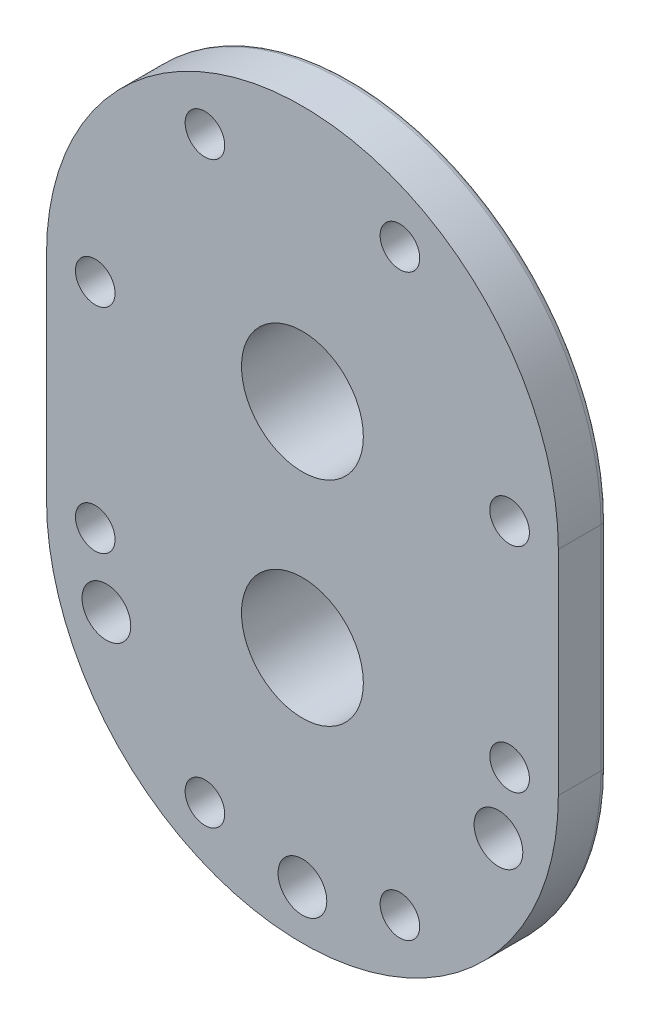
ISO-10303-21;
HEADER;
FILE_DESCRIPTION(('STEP AP214'),'2;1');
FILE_NAME('part.step','',(''),(''),'','','');
FILE_SCHEMA(('AUTOMOTIVE_DESIGN { 1 0 10303 214 1 1 1 1 }'));
ENDSEC;
DATA;
#1=APPLICATION_CONTEXT('core data for automotive mechanical design processes');
#2=APPLICATION_PROTOCOL_DEFINITION('international standard','automotive_design',2000,#1);
#3=PRODUCT_CONTEXT('',#1,'mechanical');
#4=PRODUCT('Part','Part','',(#3));
#5=PRODUCT_RELATED_PRODUCT_CATEGORY('part','',(#4));
#6=PRODUCT_DEFINITION_FORMATION('','',#4);
#7=PRODUCT_DEFINITION_CONTEXT('part definition',#1,'design');
#8=PRODUCT_DEFINITION('design','',#6,#7);
#9=PRODUCT_DEFINITION_SHAPE('','',#8);
#10=(LENGTH_UNIT() NAMED_UNIT(*) SI_UNIT(.MILLI.,.METRE.));
#11=(NAMED_UNIT(*) PLANE_ANGLE_UNIT() SI_UNIT($,.RADIAN.));
#12=(NAMED_UNIT(*) SI_UNIT($,.STERADIAN.) SOLID_ANGLE_UNIT());
#13=UNCERTAINTY_MEASURE_WITH_UNIT(LENGTH_MEASURE(1.E-05),#10,'distance_accuracy_value','');
#14=(GEOMETRIC_REPRESENTATION_CONTEXT(3) GLOBAL_UNCERTAINTY_ASSIGNED_CONTEXT((#13)) GLOBAL_UNIT_ASSIGNED_CONTEXT((#10,
#11,#12)) REPRESENTATION_CONTEXT('',''));
#15=CARTESIAN_POINT('',(0.,0.,0.));
#16=DIRECTION('',(0.,0.,1.));
#17=DIRECTION('',(1.,0.,0.));
#18=AXIS2_PLACEMENT_3D('',#15,#16,#17);
#19=CARTESIAN_POINT('',(0.,0.,-8.));
#20=DIRECTION('',(0.,0.,1.));
#21=DIRECTION('',(1.,0.,0.));
#22=AXIS2_PLACEMENT_3D('',#19,#20,#21);
#23=CYLINDRICAL_SURFACE('',#22,42.);
#24=DIRECTION('',(0.,0.,1.));
#25=VECTOR('',#24,1.);
#26=CARTESIAN_POINT('',(42.,0.,-8.));
#27=LINE('',#26,#25);
#28=CARTESIAN_POINT('',(42.,0.,-7.));
#29=VERTEX_POINT('',#28);
#30=CARTESIAN_POINT('',(42.,0.,0.));
#31=VERTEX_POINT('',#30);
#32=EDGE_CURVE('E173',#29,#31,#27,.T.);
#33=ORIENTED_EDGE('',*,*,#32,.F.);
#34=CARTESIAN_POINT('',(0.,0.,-7.));
#35=DIRECTION('',(0.,0.,1.));
#36=DIRECTION('',(1.,0.,0.));
#37=AXIS2_PLACEMENT_3D('',#34,#35,#36);
#38=CIRCLE('',#37,42.);
#39=CARTESIAN_POINT('',(-42.,0.,-7.));
#40=VERTEX_POINT('',#39);
#41=EDGE_CURVE('E145',#29,#40,#38,.T.);
#42=ORIENTED_EDGE('',*,*,#41,.T.);
#43=DIRECTION('',(0.,0.,1.));
#44=VECTOR('',#43,1.);
#45=CARTESIAN_POINT('',(-42.,0.,-8.));
#46=LINE('',#45,#44);
#47=CARTESIAN_POINT('',(-42.,0.,0.));
#48=VERTEX_POINT('',#47);
#49=EDGE_CURVE('E138',#40,#48,#46,.T.);
#50=ORIENTED_EDGE('',*,*,#49,.T.);
#51=CARTESIAN_POINT('',(0.,0.,0.));
#52=DIRECTION('',(0.,0.,1.));
#53=DIRECTION('',(1.,0.,0.));
#54=AXIS2_PLACEMENT_3D('',#51,#52,#53);
#55=CIRCLE('',#54,42.);
#56=EDGE_CURVE('E142',#31,#48,#55,.T.);
#57=ORIENTED_EDGE('',*,*,#56,.F.);
#58=EDGE_LOOP('',(#33,#42,#50,#57));
#59=FACE_BOUND('',#58,.T.);
#60=ADVANCED_FACE('F34',(#59),#23,.T.);
#61=CARTESIAN_POINT('',(42.,0.,-8.));
#62=DIRECTION('',(1.,0.,0.));
#63=DIRECTION('',(0.,1.,0.));
#64=AXIS2_PLACEMENT_3D('',#61,#62,#63);
#65=PLANE('',#64);
#66=DIRECTION('',(0.,0.,1.));
#67=VECTOR('',#66,1.);
#68=CARTESIAN_POINT('',(42.,-35.,-8.));
#69=LINE('',#68,#67);
#70=CARTESIAN_POINT('',(42.,-35.,-7.));
#71=VERTEX_POINT('',#70);
#72=CARTESIAN_POINT('',(42.,-35.,0.));
#73=VERTEX_POINT('',#72);
#74=EDGE_CURVE('E176',#71,#73,#69,.T.);
#75=ORIENTED_EDGE('',*,*,#74,.F.);
#76=DIRECTION('',(0.,1.,0.));
#77=VECTOR('',#76,1.);
#78=CARTESIAN_POINT('',(42.,0.,-7.));
#79=LINE('',#78,#77);
#80=EDGE_CURVE('E175',#71,#29,#79,.T.);
#81=ORIENTED_EDGE('',*,*,#80,.T.);
#82=ORIENTED_EDGE('',*,*,#32,.T.);
#83=DIRECTION('',(0.,1.,0.));
#84=VECTOR('',#83,1.);
#85=CARTESIAN_POINT('',(42.,0.,0.));
#86=LINE('',#85,#84);
#87=EDGE_CURVE('E149',#73,#31,#86,.T.);
#88=ORIENTED_EDGE('',*,*,#87,.F.);
#89=EDGE_LOOP('',(#75,#81,#82,#88));
#90=FACE_BOUND('',#89,.T.);
#91=ADVANCED_FACE('F419',(#90),#65,.T.);
#92=CARTESIAN_POINT('',(0.,-35.,-8.));
#93=DIRECTION('',(0.,0.,1.));
#94=DIRECTION('',(1.,0.,0.));
#95=AXIS2_PLACEMENT_3D('',#92,#93,#94);
#96=CYLINDRICAL_SURFACE('',#95,42.);
#97=DIRECTION('',(0.,0.,1.));
#98=VECTOR('',#97,1.);
#99=CARTESIAN_POINT('',(-42.,-35.,-8.));
#100=LINE('',#99,#98);
#101=CARTESIAN_POINT('',(-42.,-35.,-7.));
#102=VERTEX_POINT('',#101);
#103=CARTESIAN_POINT('',(-42.,-35.,0.));
#104=VERTEX_POINT('',#103);
#105=EDGE_CURVE('E148',#102,#104,#100,.T.);
#106=ORIENTED_EDGE('',*,*,#105,.F.);
#107=CARTESIAN_POINT('',(0.,-35.,-7.));
#108=DIRECTION('',(0.,0.,1.));
#109=DIRECTION('',(1.,0.,0.));
#110=AXIS2_PLACEMENT_3D('',#107,#108,#109);
#111=CIRCLE('',#110,42.);
#112=EDGE_CURVE('E199',#102,#71,#111,.T.);
#113=ORIENTED_EDGE('',*,*,#112,.T.);
#114=ORIENTED_EDGE('',*,*,#74,.T.);
#115=CARTESIAN_POINT('',(0.,-35.,0.));
#116=DIRECTION('',(0.,0.,1.));
#117=DIRECTION('',(1.,0.,0.));
#118=AXIS2_PLACEMENT_3D('',#115,#116,#117);
#119=CIRCLE('',#118,42.);
#120=EDGE_CURVE('E158',#104,#73,#119,.T.);
#121=ORIENTED_EDGE('',*,*,#120,.F.);
#122=EDGE_LOOP('',(#106,#113,#114,#121));
#123=FACE_BOUND('',#122,.T.);
#124=ADVANCED_FACE('F424',(#123),#96,.T.);
#125=CARTESIAN_POINT('',(-42.,0.,-8.));
#126=DIRECTION('',(-1.,0.,0.));
#127=DIRECTION('',(0.,-1.,0.));
#128=AXIS2_PLACEMENT_3D('',#125,#126,#127);
#129=PLANE('',#128);
#130=ORIENTED_EDGE('',*,*,#49,.F.);
#131=DIRECTION('',(0.,-1.,0.));
#132=VECTOR('',#131,1.);
#133=CARTESIAN_POINT('',(-42.,-35.,-7.));
#134=LINE('',#133,#132);
#135=EDGE_CURVE('E201',#40,#102,#134,.T.);
#136=ORIENTED_EDGE('',*,*,#135,.T.);
#137=ORIENTED_EDGE('',*,*,#105,.T.);
#138=DIRECTION('',(0.,-1.,0.));
#139=VECTOR('',#138,1.);
#140=CARTESIAN_POINT('',(-42.,0.,0.));
#141=LINE('',#140,#139);
#142=EDGE_CURVE('E152',#48,#104,#141,.T.);
#143=ORIENTED_EDGE('',*,*,#142,.F.);
#144=EDGE_LOOP('',(#130,#136,#137,#143));
#145=FACE_BOUND('',#144,.T.);
#146=ADVANCED_FACE('F153',(#145),#129,.T.);
#147=CARTESIAN_POINT('',(0.,0.,-8.));
#148=DIRECTION('',(0.,0.,1.));
#149=DIRECTION('',(1.,0.,0.));
#150=AXIS2_PLACEMENT_3D('',#147,#148,#149);
#151=PLANE('',#150);
#152=CARTESIAN_POINT('',(32.1714158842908,-46.,-8.));
#153=DIRECTION('',(0.,0.,1.));
#154=DIRECTION('',(1.,0.,0.));
#155=AXIS2_PLACEMENT_3D('',#152,#153,#154);
#156=CIRCLE('',#155,4.);
#157=CARTESIAN_POINT('',(36.1714158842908,-46.,-8.));
#158=VERTEX_POINT('',#157);
#159=EDGE_CURVE('E365',#158,#158,#156,.T.);
#160=ORIENTED_EDGE('',*,*,#159,.T.);
#161=EDGE_LOOP('',(#160));
#162=FACE_BOUND('',#161,.T.);
#163=CARTESIAN_POINT('',(0.,-69.,-8.));
#164=DIRECTION('',(0.,0.,1.));
#165=DIRECTION('',(1.,0.,0.));
#166=AXIS2_PLACEMENT_3D('',#163,#164,#165);
#167=CIRCLE('',#166,4.);
#168=CARTESIAN_POINT('',(4.00000000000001,-69.,-8.));
#169=VERTEX_POINT('',#168);
#170=EDGE_CURVE('E359',#169,#169,#167,.T.);
#171=ORIENTED_EDGE('',*,*,#170,.T.);
#172=EDGE_LOOP('',(#171));
#173=FACE_BOUND('',#172,.T.);
#174=CARTESIAN_POINT('',(-32.1714158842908,-46.,-8.));
#175=DIRECTION('',(0.,0.,1.));
#176=DIRECTION('',(1.,0.,0.));
#177=AXIS2_PLACEMENT_3D('',#174,#175,#176);
#178=CIRCLE('',#177,4.);
#179=CARTESIAN_POINT('',(-28.1714158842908,-46.,-8.));
#180=VERTEX_POINT('',#179);
#181=EDGE_CURVE('E249',#180,#180,#178,.T.);
#182=ORIENTED_EDGE('',*,*,#181,.T.);
#183=EDGE_LOOP('',(#182));
#184=FACE_BOUND('',#183,.T.);
#185=CARTESIAN_POINT('',(0.,0.,-8.));
#186=DIRECTION('',(0.,0.,1.));
#187=DIRECTION('',(1.,0.,0.));
#188=AXIS2_PLACEMENT_3D('',#185,#186,#187);
#189=CIRCLE('',#188,41.);
#190=CARTESIAN_POINT('',(-41.,0.,-8.));
#191=VERTEX_POINT('',#190);
#192=CARTESIAN_POINT('',(41.,0.,-8.));
#193=VERTEX_POINT('',#192);
#194=EDGE_CURVE('E190',#191,#193,#189,.F.);
#195=ORIENTED_EDGE('',*,*,#194,.T.);
#196=DIRECTION('',(0.,1.,0.));
#197=VECTOR('',#196,1.);
#198=CARTESIAN_POINT('',(41.,-35.,-8.));
#199=LINE('',#198,#197);
#200=CARTESIAN_POINT('',(41.,-35.,-8.));
#201=VERTEX_POINT('',#200);
#202=EDGE_CURVE('E196',#193,#201,#199,.F.);
#203=ORIENTED_EDGE('',*,*,#202,.T.);
#204=CARTESIAN_POINT('',(0.,-35.,-8.));
#205=DIRECTION('',(0.,0.,1.));
#206=DIRECTION('',(1.,0.,0.));
#207=AXIS2_PLACEMENT_3D('',#204,#205,#206);
#208=CIRCLE('',#207,41.);
#209=CARTESIAN_POINT('',(-41.,-35.,-8.));
#210=VERTEX_POINT('',#209);
#211=EDGE_CURVE('E194',#201,#210,#208,.F.);
#212=ORIENTED_EDGE('',*,*,#211,.T.);
#213=DIRECTION('',(0.,-1.,0.));
#214=VECTOR('',#213,1.);
#215=CARTESIAN_POINT('',(-41.,0.,-8.));
#216=LINE('',#215,#214);
#217=EDGE_CURVE('E192',#210,#191,#216,.F.);
#218=ORIENTED_EDGE('',*,*,#217,.T.);
#219=EDGE_LOOP('',(#195,#203,#212,#218));
#220=FACE_BOUND('',#219,.T.);
#221=CARTESIAN_POINT('',(0.,-35.,-8.));
#222=DIRECTION('',(0.,0.,1.));
#223=DIRECTION('',(1.,0.,0.));
#224=AXIS2_PLACEMENT_3D('',#221,#222,#223);
#225=CIRCLE('',#224,19.);
#226=CARTESIAN_POINT('',(-19.,-35.,-8.));
#227=VERTEX_POINT('',#226);
#228=CARTESIAN_POINT('',(19.,-35.,-8.));
#229=VERTEX_POINT('',#228);
#230=EDGE_CURVE('E185',#227,#229,#225,.T.);
#231=ORIENTED_EDGE('',*,*,#230,.T.);
#232=DIRECTION('',(0.,1.,0.));
#233=VECTOR('',#232,1.);
#234=CARTESIAN_POINT('',(19.,0.,-8.));
#235=LINE('',#234,#233);
#236=CARTESIAN_POINT('',(19.,0.,-8.));
#237=VERTEX_POINT('',#236);
#238=EDGE_CURVE('E187',#229,#237,#235,.T.);
#239=ORIENTED_EDGE('',*,*,#238,.T.);
#240=CARTESIAN_POINT('',(0.,0.,-8.));
#241=DIRECTION('',(0.,0.,1.));
#242=DIRECTION('',(1.,0.,0.));
#243=AXIS2_PLACEMENT_3D('',#240,#241,#242);
#244=CIRCLE('',#243,19.);
#245=CARTESIAN_POINT('',(-19.,0.,-8.));
#246=VERTEX_POINT('',#245);
#247=EDGE_CURVE('E181',#237,#246,#244,.T.);
#248=ORIENTED_EDGE('',*,*,#247,.T.);
#249=DIRECTION('',(0.,-1.,0.));
#250=VECTOR('',#249,1.);
#251=CARTESIAN_POINT('',(-19.,0.,-8.));
#252=LINE('',#251,#250);
#253=EDGE_CURVE('E183',#246,#227,#252,.T.);
#254=ORIENTED_EDGE('',*,*,#253,.T.);
#255=EDGE_LOOP('',(#231,#239,#248,#254));
#256=FACE_BOUND('',#255,.T.);
#257=CARTESIAN_POINT('',(-34.,0.,-8.));
#258=DIRECTION('',(0.,0.,1.));
#259=DIRECTION('',(1.,0.,0.));
#260=AXIS2_PLACEMENT_3D('',#257,#258,#259);
#261=CIRCLE('',#260,3.25);
#262=CARTESIAN_POINT('',(-30.75,0.,-8.));
#263=VERTEX_POINT('',#262);
#264=EDGE_CURVE('E349',#263,#263,#261,.T.);
#265=ORIENTED_EDGE('',*,*,#264,.T.);
#266=EDGE_LOOP('',(#265));
#267=FACE_BOUND('',#266,.T.);
#268=CARTESIAN_POINT('',(-34.,-35.0000000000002,-8.));
#269=DIRECTION('',(0.,0.,1.));
#270=DIRECTION('',(1.,0.,0.));
#271=AXIS2_PLACEMENT_3D('',#268,#269,#270);
#272=CIRCLE('',#271,3.25);
#273=CARTESIAN_POINT('',(-30.75,-35.0000000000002,-8.));
#274=VERTEX_POINT('',#273);
#275=EDGE_CURVE('E343',#274,#274,#272,.T.);
#276=ORIENTED_EDGE('',*,*,#275,.T.);
#277=EDGE_LOOP('',(#276));
#278=FACE_BOUND('',#277,.T.);
#279=CARTESIAN_POINT('',(-16.,-65.,-8.));
#280=DIRECTION('',(0.,0.,1.));
#281=DIRECTION('',(1.,0.,0.));
#282=AXIS2_PLACEMENT_3D('',#279,#280,#281);
#283=CIRCLE('',#282,3.25);
#284=CARTESIAN_POINT('',(-12.75,-65.,-8.));
#285=VERTEX_POINT('',#284);
#286=EDGE_CURVE('E337',#285,#285,#283,.T.);
#287=ORIENTED_EDGE('',*,*,#286,.T.);
#288=EDGE_LOOP('',(#287));
#289=FACE_BOUND('',#288,.T.);
#290=CARTESIAN_POINT('',(16.,-65.,-8.));
#291=DIRECTION('',(0.,0.,1.));
#292=DIRECTION('',(1.,0.,0.));
#293=AXIS2_PLACEMENT_3D('',#290,#291,#292);
#294=CIRCLE('',#293,3.25);
#295=CARTESIAN_POINT('',(19.25,-65.,-8.));
#296=VERTEX_POINT('',#295);
#297=EDGE_CURVE('E331',#296,#296,#294,.T.);
#298=ORIENTED_EDGE('',*,*,#297,.T.);
#299=EDGE_LOOP('',(#298));
#300=FACE_BOUND('',#299,.T.);
#301=CARTESIAN_POINT('',(34.,-35.,-8.));
#302=DIRECTION('',(0.,0.,1.));
#303=DIRECTION('',(1.,0.,0.));
#304=AXIS2_PLACEMENT_3D('',#301,#302,#303);
#305=CIRCLE('',#304,3.25);
#306=CARTESIAN_POINT('',(37.25,-35.,-8.));
#307=VERTEX_POINT('',#306);
#308=EDGE_CURVE('E325',#307,#307,#305,.T.);
#309=ORIENTED_EDGE('',*,*,#308,.T.);
#310=EDGE_LOOP('',(#309));
#311=FACE_BOUND('',#310,.T.);
#312=CARTESIAN_POINT('',(34.,0.,-8.));
#313=DIRECTION('',(0.,0.,1.));
#314=DIRECTION('',(1.,0.,0.));
#315=AXIS2_PLACEMENT_3D('',#312,#313,#314);
#316=CIRCLE('',#315,3.25);
#317=CARTESIAN_POINT('',(37.25,0.,-8.));
#318=VERTEX_POINT('',#317);
#319=EDGE_CURVE('E319',#318,#318,#316,.T.);
#320=ORIENTED_EDGE('',*,*,#319,.T.);
#321=EDGE_LOOP('',(#320));
#322=FACE_BOUND('',#321,.T.);
#323=CARTESIAN_POINT('',(16.,30.,-8.));
#324=DIRECTION('',(0.,0.,1.));
#325=DIRECTION('',(1.,0.,0.));
#326=AXIS2_PLACEMENT_3D('',#323,#324,#325);
#327=CIRCLE('',#326,3.25);
#328=CARTESIAN_POINT('',(19.25,30.,-8.));
#329=VERTEX_POINT('',#328);
#330=EDGE_CURVE('E313',#329,#329,#327,.T.);
#331=ORIENTED_EDGE('',*,*,#330,.T.);
#332=EDGE_LOOP('',(#331));
#333=FACE_BOUND('',#332,.T.);
#334=CARTESIAN_POINT('',(-16.,30.,-8.));
#335=DIRECTION('',(0.,0.,1.));
#336=DIRECTION('',(1.,0.,0.));
#337=AXIS2_PLACEMENT_3D('',#334,#335,#336);
#338=CIRCLE('',#337,3.25);
#339=CARTESIAN_POINT('',(-12.75,30.,-8.));
#340=VERTEX_POINT('',#339);
#341=EDGE_CURVE('E305',#340,#340,#338,.T.);
#342=ORIENTED_EDGE('',*,*,#341,.T.);
#343=EDGE_LOOP('',(#342));
#344=FACE_BOUND('',#343,.T.);
#345=ADVANCED_FACE('F377',(#162,#173,#184,#220,#256,#267,#278,#289,#300,#311,#322,#333,#344),
#151,.F.);
#346=CARTESIAN_POINT('',(0.,0.,0.));
#347=DIRECTION('',(0.,0.,1.));
#348=DIRECTION('',(1.,0.,0.));
#349=AXIS2_PLACEMENT_3D('',#346,#347,#348);
#350=PLANE('',#349);
#351=CARTESIAN_POINT('',(32.1714158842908,-46.,0.));
#352=DIRECTION('',(0.,0.,1.));
#353=DIRECTION('',(1.,0.,0.));
#354=AXIS2_PLACEMENT_3D('',#351,#352,#353);
#355=CIRCLE('',#354,4.);
#356=CARTESIAN_POINT('',(36.1714158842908,-46.,0.));
#357=VERTEX_POINT('',#356);
#358=EDGE_CURVE('E368',#357,#357,#355,.T.);
#359=ORIENTED_EDGE('',*,*,#358,.F.);
#360=EDGE_LOOP('',(#359));
#361=FACE_BOUND('',#360,.T.);
#362=CARTESIAN_POINT('',(0.,-69.,0.));
#363=DIRECTION('',(0.,0.,1.));
#364=DIRECTION('',(1.,0.,0.));
#365=AXIS2_PLACEMENT_3D('',#362,#363,#364);
#366=CIRCLE('',#365,4.);
#367=CARTESIAN_POINT('',(4.00000000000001,-69.,0.));
#368=VERTEX_POINT('',#367);
#369=EDGE_CURVE('E362',#368,#368,#366,.T.);
#370=ORIENTED_EDGE('',*,*,#369,.F.);
#371=EDGE_LOOP('',(#370));
#372=FACE_BOUND('',#371,.T.);
#373=CARTESIAN_POINT('',(-32.1714158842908,-46.,0.));
#374=DIRECTION('',(0.,0.,1.));
#375=DIRECTION('',(1.,0.,0.));
#376=AXIS2_PLACEMENT_3D('',#373,#374,#375);
#377=CIRCLE('',#376,4.);
#378=CARTESIAN_POINT('',(-28.1714158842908,-46.,0.));
#379=VERTEX_POINT('',#378);
#380=EDGE_CURVE('E356',#379,#379,#377,.T.);
#381=ORIENTED_EDGE('',*,*,#380,.F.);
#382=EDGE_LOOP('',(#381));
#383=FACE_BOUND('',#382,.T.);
#384=CARTESIAN_POINT('',(-34.,0.,0.));
#385=DIRECTION('',(0.,0.,1.));
#386=DIRECTION('',(1.,0.,0.));
#387=AXIS2_PLACEMENT_3D('',#384,#385,#386);
#388=CIRCLE('',#387,3.25);
#389=CARTESIAN_POINT('',(-30.75,0.,0.));
#390=VERTEX_POINT('',#389);
#391=EDGE_CURVE('E237',#390,#390,#388,.T.);
#392=ORIENTED_EDGE('',*,*,#391,.F.);
#393=EDGE_LOOP('',(#392));
#394=FACE_BOUND('',#393,.T.);
#395=CARTESIAN_POINT('',(-34.,-35.0000000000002,0.));
#396=DIRECTION('',(0.,0.,1.));
#397=DIRECTION('',(1.,0.,0.));
#398=AXIS2_PLACEMENT_3D('',#395,#396,#397);
#399=CIRCLE('',#398,3.25);
#400=CARTESIAN_POINT('',(-30.75,-35.0000000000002,0.));
#401=VERTEX_POINT('',#400);
#402=EDGE_CURVE('E346',#401,#401,#399,.T.);
#403=ORIENTED_EDGE('',*,*,#402,.F.);
#404=EDGE_LOOP('',(#403));
#405=FACE_BOUND('',#404,.T.);
#406=CARTESIAN_POINT('',(-16.,-65.,0.));
#407=DIRECTION('',(0.,0.,1.));
#408=DIRECTION('',(1.,0.,0.));
#409=AXIS2_PLACEMENT_3D('',#406,#407,#408);
#410=CIRCLE('',#409,3.25);
#411=CARTESIAN_POINT('',(-12.75,-65.,0.));
#412=VERTEX_POINT('',#411);
#413=EDGE_CURVE('E340',#412,#412,#410,.T.);
#414=ORIENTED_EDGE('',*,*,#413,.F.);
#415=EDGE_LOOP('',(#414));
#416=FACE_BOUND('',#415,.T.);
#417=CARTESIAN_POINT('',(16.,-65.,0.));
#418=DIRECTION('',(0.,0.,1.));
#419=DIRECTION('',(1.,0.,0.));
#420=AXIS2_PLACEMENT_3D('',#417,#418,#419);
#421=CIRCLE('',#420,3.25);
#422=CARTESIAN_POINT('',(19.25,-65.,0.));
#423=VERTEX_POINT('',#422);
#424=EDGE_CURVE('E334',#423,#423,#421,.T.);
#425=ORIENTED_EDGE('',*,*,#424,.F.);
#426=EDGE_LOOP('',(#425));
#427=FACE_BOUND('',#426,.T.);
#428=CARTESIAN_POINT('',(34.,-35.,0.));
#429=DIRECTION('',(0.,0.,1.));
#430=DIRECTION('',(1.,0.,0.));
#431=AXIS2_PLACEMENT_3D('',#428,#429,#430);
#432=CIRCLE('',#431,3.25);
#433=CARTESIAN_POINT('',(37.25,-35.,0.));
#434=VERTEX_POINT('',#433);
#435=EDGE_CURVE('E328',#434,#434,#432,.T.);
#436=ORIENTED_EDGE('',*,*,#435,.F.);
#437=EDGE_LOOP('',(#436));
#438=FACE_BOUND('',#437,.T.);
#439=CARTESIAN_POINT('',(34.,0.,0.));
#440=DIRECTION('',(0.,0.,1.));
#441=DIRECTION('',(1.,0.,0.));
#442=AXIS2_PLACEMENT_3D('',#439,#440,#441);
#443=CIRCLE('',#442,3.25);
#444=CARTESIAN_POINT('',(37.25,0.,0.));
#445=VERTEX_POINT('',#444);
#446=EDGE_CURVE('E322',#445,#445,#443,.T.);
#447=ORIENTED_EDGE('',*,*,#446,.F.);
#448=EDGE_LOOP('',(#447));
#449=FACE_BOUND('',#448,.T.);
#450=CARTESIAN_POINT('',(16.,30.,0.));
#451=DIRECTION('',(0.,0.,1.));
#452=DIRECTION('',(1.,0.,0.));
#453=AXIS2_PLACEMENT_3D('',#450,#451,#452);
#454=CIRCLE('',#453,3.25);
#455=CARTESIAN_POINT('',(19.25,30.,0.));
#456=VERTEX_POINT('',#455);
#457=EDGE_CURVE('E316',#456,#456,#454,.T.);
#458=ORIENTED_EDGE('',*,*,#457,.F.);
#459=EDGE_LOOP('',(#458));
#460=FACE_BOUND('',#459,.T.);
#461=CARTESIAN_POINT('',(-16.,30.,0.));
#462=DIRECTION('',(0.,0.,1.));
#463=DIRECTION('',(1.,0.,0.));
#464=AXIS2_PLACEMENT_3D('',#461,#462,#463);
#465=CIRCLE('',#464,3.25);
#466=CARTESIAN_POINT('',(-12.75,30.,0.));
#467=VERTEX_POINT('',#466);
#468=EDGE_CURVE('E310',#467,#467,#465,.T.);
#469=ORIENTED_EDGE('',*,*,#468,.F.);
#470=EDGE_LOOP('',(#469));
#471=FACE_BOUND('',#470,.T.);
#472=CARTESIAN_POINT('',(0.,-35.,0.));
#473=DIRECTION('',(0.,0.,1.));
#474=DIRECTION('',(1.,0.,0.));
#475=AXIS2_PLACEMENT_3D('',#472,#473,#474);
#476=CIRCLE('',#475,10.);
#477=CARTESIAN_POINT('',(10.,-35.,0.));
#478=VERTEX_POINT('',#477);
#479=EDGE_CURVE('E302',#478,#478,#476,.T.);
#480=ORIENTED_EDGE('',*,*,#479,.F.);
#481=EDGE_LOOP('',(#480));
#482=FACE_BOUND('',#481,.T.);
#483=CARTESIAN_POINT('',(0.,0.,0.));
#484=DIRECTION('',(0.,0.,1.));
#485=DIRECTION('',(1.,0.,0.));
#486=AXIS2_PLACEMENT_3D('',#483,#484,#485);
#487=CIRCLE('',#486,10.);
#488=CARTESIAN_POINT('',(10.,0.,0.));
#489=VERTEX_POINT('',#488);
#490=EDGE_CURVE('E295',#489,#489,#487,.T.);
#491=ORIENTED_EDGE('',*,*,#490,.F.);
#492=EDGE_LOOP('',(#491));
#493=FACE_BOUND('',#492,.T.);
#494=ORIENTED_EDGE('',*,*,#56,.T.);
#495=ORIENTED_EDGE('',*,*,#142,.T.);
#496=ORIENTED_EDGE('',*,*,#120,.T.);
#497=ORIENTED_EDGE('',*,*,#87,.T.);
#498=EDGE_LOOP('',(#494,#495,#496,#497));
#499=FACE_BOUND('',#498,.T.);
#500=ADVANCED_FACE('F160',(#361,#372,#383,#394,#405,#416,#427,#438,#449,#460,#471,#482,#493,
#499),#350,.T.);
#501=CARTESIAN_POINT('',(0.,0.,-24.5));
#502=DIRECTION('',(0.,0.,1.));
#503=DIRECTION('',(1.,0.,0.));
#504=AXIS2_PLACEMENT_3D('',#501,#502,#503);
#505=CYLINDRICAL_SURFACE('',#504,18.);
#506=DIRECTION('',(0.,0.,1.));
#507=VECTOR('',#506,1.);
#508=CARTESIAN_POINT('',(-18.,0.,-24.5));
#509=LINE('',#508,#507);
#510=CARTESIAN_POINT('',(-18.,0.,-23.5));
#511=VERTEX_POINT('',#510);
#512=CARTESIAN_POINT('',(-18.,0.,-9.));
#513=VERTEX_POINT('',#512);
#514=EDGE_CURVE('E168',#511,#513,#509,.T.);
#515=ORIENTED_EDGE('',*,*,#514,.T.);
#516=CARTESIAN_POINT('',(0.,0.,-9.));
#517=DIRECTION('',(0.,0.,1.));
#518=DIRECTION('',(1.,0.,0.));
#519=AXIS2_PLACEMENT_3D('',#516,#517,#518);
#520=CIRCLE('',#519,18.);
#521=CARTESIAN_POINT('',(18.,0.,-9.));
#522=VERTEX_POINT('',#521);
#523=EDGE_CURVE('E11',#513,#522,#520,.F.);
#524=ORIENTED_EDGE('',*,*,#523,.T.);
#525=DIRECTION('',(0.,0.,1.));
#526=VECTOR('',#525,1.);
#527=CARTESIAN_POINT('',(18.,0.,-24.5));
#528=LINE('',#527,#526);
#529=CARTESIAN_POINT('',(18.,0.,-23.5));
#530=VERTEX_POINT('',#529);
#531=EDGE_CURVE('E162',#530,#522,#528,.T.);
#532=ORIENTED_EDGE('',*,*,#531,.F.);
#533=CARTESIAN_POINT('',(0.,0.,-23.5));
#534=DIRECTION('',(0.,0.,1.));
#535=DIRECTION('',(1.,0.,0.));
#536=AXIS2_PLACEMENT_3D('',#533,#534,#535);
#537=CIRCLE('',#536,18.);
#538=EDGE_CURVE('E43',#530,#511,#537,.T.);
#539=ORIENTED_EDGE('',*,*,#538,.T.);
#540=EDGE_LOOP('',(#515,#524,#532,#539));
#541=FACE_BOUND('',#540,.T.);
#542=ADVANCED_FACE('F276',(#541),#505,.T.);
#543=CARTESIAN_POINT('',(18.,0.,-24.5));
#544=DIRECTION('',(1.,0.,0.));
#545=DIRECTION('',(0.,1.,0.));
#546=AXIS2_PLACEMENT_3D('',#543,#544,#545);
#547=PLANE('',#546);
#548=ORIENTED_EDGE('',*,*,#531,.T.);
#549=DIRECTION('',(0.,1.,0.));
#550=VECTOR('',#549,1.);
#551=CARTESIAN_POINT('',(18.,0.,-9.));
#552=LINE('',#551,#550);
#553=CARTESIAN_POINT('',(18.,-35.,-9.));
#554=VERTEX_POINT('',#553);
#555=EDGE_CURVE('E206',#522,#554,#552,.F.);
#556=ORIENTED_EDGE('',*,*,#555,.T.);
#557=DIRECTION('',(0.,0.,1.));
#558=VECTOR('',#557,1.);
#559=CARTESIAN_POINT('',(18.,-35.,-24.5));
#560=LINE('',#559,#558);
#561=CARTESIAN_POINT('',(18.,-35.,-23.5));
#562=VERTEX_POINT('',#561);
#563=EDGE_CURVE('E165',#562,#554,#560,.T.);
#564=ORIENTED_EDGE('',*,*,#563,.F.);
#565=DIRECTION('',(0.,1.,0.));
#566=VECTOR('',#565,1.);
#567=CARTESIAN_POINT('',(18.,0.,-23.5));
#568=LINE('',#567,#566);
#569=EDGE_CURVE('E203',#562,#530,#568,.T.);
#570=ORIENTED_EDGE('',*,*,#569,.T.);
#571=EDGE_LOOP('',(#548,#556,#564,#570));
#572=FACE_BOUND('',#571,.T.);
#573=ADVANCED_FACE('F273',(#572),#547,.T.);
#574=CARTESIAN_POINT('',(0.,-35.,-24.5));
#575=DIRECTION('',(0.,0.,1.));
#576=DIRECTION('',(1.,0.,0.));
#577=AXIS2_PLACEMENT_3D('',#574,#575,#576);
#578=CYLINDRICAL_SURFACE('',#577,18.);
#579=ORIENTED_EDGE('',*,*,#563,.T.);
#580=CARTESIAN_POINT('',(0.,-35.,-9.));
#581=DIRECTION('',(0.,0.,1.));
#582=DIRECTION('',(1.,0.,0.));
#583=AXIS2_PLACEMENT_3D('',#580,#581,#582);
#584=CIRCLE('',#583,18.);
#585=CARTESIAN_POINT('',(-18.,-35.,-9.));
#586=VERTEX_POINT('',#585);
#587=EDGE_CURVE('E211',#554,#586,#584,.F.);
#588=ORIENTED_EDGE('',*,*,#587,.T.);
#589=DIRECTION('',(0.,0.,1.));
#590=VECTOR('',#589,1.);
#591=CARTESIAN_POINT('',(-18.,-35.,-24.5));
#592=LINE('',#591,#590);
#593=CARTESIAN_POINT('',(-18.,-35.,-23.5));
#594=VERTEX_POINT('',#593);
#595=EDGE_CURVE('E292',#594,#586,#592,.T.);
#596=ORIENTED_EDGE('',*,*,#595,.F.);
#597=CARTESIAN_POINT('',(0.,-35.,-23.5));
#598=DIRECTION('',(0.,0.,1.));
#599=DIRECTION('',(1.,0.,0.));
#600=AXIS2_PLACEMENT_3D('',#597,#598,#599);
#601=CIRCLE('',#600,18.);
#602=EDGE_CURVE('E209',#594,#562,#601,.T.);
#603=ORIENTED_EDGE('',*,*,#602,.T.);
#604=EDGE_LOOP('',(#579,#588,#596,#603));
#605=FACE_BOUND('',#604,.T.);
#606=ADVANCED_FACE('F289',(#605),#578,.T.);
#607=CARTESIAN_POINT('',(-18.,0.,-24.5));
#608=DIRECTION('',(-1.,0.,0.));
#609=DIRECTION('',(0.,-1.,0.));
#610=AXIS2_PLACEMENT_3D('',#607,#608,#609);
#611=PLANE('',#610);
#612=ORIENTED_EDGE('',*,*,#595,.T.);
#613=DIRECTION('',(0.,-1.,0.));
#614=VECTOR('',#613,1.);
#615=CARTESIAN_POINT('',(-18.,0.,-9.));
#616=LINE('',#615,#614);
#617=EDGE_CURVE('E215',#586,#513,#616,.F.);
#618=ORIENTED_EDGE('',*,*,#617,.T.);
#619=ORIENTED_EDGE('',*,*,#514,.F.);
#620=DIRECTION('',(0.,-1.,0.));
#621=VECTOR('',#620,1.);
#622=CARTESIAN_POINT('',(-18.,-35.,-23.5));
#623=LINE('',#622,#621);
#624=EDGE_CURVE('E213',#511,#594,#623,.T.);
#625=ORIENTED_EDGE('',*,*,#624,.T.);
#626=EDGE_LOOP('',(#612,#618,#619,#625));
#627=FACE_BOUND('',#626,.T.);
#628=ADVANCED_FACE('F415',(#627),#611,.T.);
#629=CARTESIAN_POINT('',(0.,0.,-24.5));
#630=DIRECTION('',(0.,0.,1.));
#631=DIRECTION('',(1.,0.,0.));
#632=AXIS2_PLACEMENT_3D('',#629,#630,#631);
#633=PLANE('',#632);
#634=CARTESIAN_POINT('',(0.,0.,-24.5));
#635=DIRECTION('',(0.,0.,1.));
#636=DIRECTION('',(1.,0.,0.));
#637=AXIS2_PLACEMENT_3D('',#634,#635,#636);
#638=CIRCLE('',#637,17.);
#639=CARTESIAN_POINT('',(-17.,0.,-24.5));
#640=VERTEX_POINT('',#639);
#641=CARTESIAN_POINT('',(17.,0.,-24.5));
#642=VERTEX_POINT('',#641);
#643=EDGE_CURVE('E217',#640,#642,#638,.F.);
#644=ORIENTED_EDGE('',*,*,#643,.T.);
#645=DIRECTION('',(0.,1.,0.));
#646=VECTOR('',#645,1.);
#647=CARTESIAN_POINT('',(17.,-35.,-24.5));
#648=LINE('',#647,#646);
#649=CARTESIAN_POINT('',(17.,-35.,-24.5));
#650=VERTEX_POINT('',#649);
#651=EDGE_CURVE('E222',#642,#650,#648,.F.);
#652=ORIENTED_EDGE('',*,*,#651,.T.);
#653=CARTESIAN_POINT('',(0.,-35.,-24.5));
#654=DIRECTION('',(0.,0.,1.));
#655=DIRECTION('',(1.,0.,0.));
#656=AXIS2_PLACEMENT_3D('',#653,#654,#655);
#657=CIRCLE('',#656,17.);
#658=CARTESIAN_POINT('',(-17.,-35.,-24.5));
#659=VERTEX_POINT('',#658);
#660=EDGE_CURVE('E58',#650,#659,#657,.F.);
#661=ORIENTED_EDGE('',*,*,#660,.T.);
#662=DIRECTION('',(0.,-1.,0.));
#663=VECTOR('',#662,1.);
#664=CARTESIAN_POINT('',(-17.,0.,-24.5));
#665=LINE('',#664,#663);
#666=EDGE_CURVE('E219',#659,#640,#665,.F.);
#667=ORIENTED_EDGE('',*,*,#666,.T.);
#668=EDGE_LOOP('',(#644,#652,#661,#667));
#669=FACE_BOUND('',#668,.T.);
#670=ADVANCED_FACE('F263',(#669),#633,.F.);
#671=CARTESIAN_POINT('',(0.,0.,-19.5));
#672=DIRECTION('',(0.,0.,1.));
#673=DIRECTION('',(1.,0.,0.));
#674=AXIS2_PLACEMENT_3D('',#671,#672,#673);
#675=CYLINDRICAL_SURFACE('',#674,10.);
#676=CARTESIAN_POINT('',(0.,0.,-19.5));
#677=DIRECTION('',(0.,0.,1.));
#678=DIRECTION('',(1.,0.,0.));
#679=AXIS2_PLACEMENT_3D('',#676,#677,#678);
#680=CIRCLE('',#679,10.);
#681=CARTESIAN_POINT('',(10.,0.,-19.5));
#682=VERTEX_POINT('',#681);
#683=EDGE_CURVE('E298',#682,#682,#680,.T.);
#684=ORIENTED_EDGE('',*,*,#683,.F.);
#685=EDGE_LOOP('',(#684));
#686=FACE_BOUND('',#685,.T.);
#687=ORIENTED_EDGE('',*,*,#490,.T.);
#688=EDGE_LOOP('',(#687));
#689=FACE_BOUND('',#688,.T.);
#690=ADVANCED_FACE('F403',(#686,#689),#675,.F.);
#691=CARTESIAN_POINT('',(0.,0.,-19.5));
#692=DIRECTION('',(0.,0.,1.));
#693=DIRECTION('',(1.,0.,0.));
#694=AXIS2_PLACEMENT_3D('',#691,#692,#693);
#695=PLANE('',#694);
#696=ORIENTED_EDGE('',*,*,#683,.T.);
#697=EDGE_LOOP('',(#696));
#698=FACE_BOUND('',#697,.T.);
#699=ADVANCED_FACE('F405',(#698),#695,.T.);
#700=CARTESIAN_POINT('',(0.,-35.,-19.5));
#701=DIRECTION('',(0.,0.,1.));
#702=DIRECTION('',(1.,0.,0.));
#703=AXIS2_PLACEMENT_3D('',#700,#701,#702);
#704=CYLINDRICAL_SURFACE('',#703,10.);
#705=CARTESIAN_POINT('',(0.,-35.,-19.5));
#706=DIRECTION('',(0.,0.,1.));
#707=DIRECTION('',(1.,0.,0.));
#708=AXIS2_PLACEMENT_3D('',#705,#706,#707);
#709=CIRCLE('',#708,10.);
#710=CARTESIAN_POINT('',(10.,-35.,-19.5));
#711=VERTEX_POINT('',#710);
#712=EDGE_CURVE('E299',#711,#711,#709,.T.);
#713=ORIENTED_EDGE('',*,*,#712,.F.);
#714=EDGE_LOOP('',(#713));
#715=FACE_BOUND('',#714,.T.);
#716=ORIENTED_EDGE('',*,*,#479,.T.);
#717=EDGE_LOOP('',(#716));
#718=FACE_BOUND('',#717,.T.);
#719=ADVANCED_FACE('F412',(#715,#718),#704,.F.);
#720=CARTESIAN_POINT('',(0.,-35.,-19.5));
#721=DIRECTION('',(0.,0.,1.));
#722=DIRECTION('',(1.,0.,0.));
#723=AXIS2_PLACEMENT_3D('',#720,#721,#722);
#724=PLANE('',#723);
#725=ORIENTED_EDGE('',*,*,#712,.T.);
#726=EDGE_LOOP('',(#725));
#727=FACE_BOUND('',#726,.T.);
#728=ADVANCED_FACE('F564',(#727),#724,.T.);
#729=CARTESIAN_POINT('',(-16.,30.,-24.5));
#730=DIRECTION('',(0.,0.,1.));
#731=DIRECTION('',(1.,0.,0.));
#732=AXIS2_PLACEMENT_3D('',#729,#730,#731);
#733=CYLINDRICAL_SURFACE('',#732,3.25);
#734=ORIENTED_EDGE('',*,*,#468,.T.);
#735=EDGE_LOOP('',(#734));
#736=FACE_BOUND('',#735,.T.);
#737=ORIENTED_EDGE('',*,*,#341,.F.);
#738=EDGE_LOOP('',(#737));
#739=FACE_BOUND('',#738,.T.);
#740=ADVANCED_FACE('F556',(#736,#739),#733,.F.);
#741=CARTESIAN_POINT('',(16.,30.,-24.5));
#742=DIRECTION('',(0.,0.,1.));
#743=DIRECTION('',(1.,0.,0.));
#744=AXIS2_PLACEMENT_3D('',#741,#742,#743);
#745=CYLINDRICAL_SURFACE('',#744,3.25);
#746=ORIENTED_EDGE('',*,*,#457,.T.);
#747=EDGE_LOOP('',(#746));
#748=FACE_BOUND('',#747,.T.);
#749=ORIENTED_EDGE('',*,*,#330,.F.);
#750=EDGE_LOOP('',(#749));
#751=FACE_BOUND('',#750,.T.);
#752=ADVANCED_FACE('F548',(#748,#751),#745,.F.);
#753=CARTESIAN_POINT('',(34.,0.,-24.5));
#754=DIRECTION('',(0.,0.,1.));
#755=DIRECTION('',(1.,0.,0.));
#756=AXIS2_PLACEMENT_3D('',#753,#754,#755);
#757=CYLINDRICAL_SURFACE('',#756,3.25);
#758=ORIENTED_EDGE('',*,*,#446,.T.);
#759=EDGE_LOOP('',(#758));
#760=FACE_BOUND('',#759,.T.);
#761=ORIENTED_EDGE('',*,*,#319,.F.);
#762=EDGE_LOOP('',(#761));
#763=FACE_BOUND('',#762,.T.);
#764=ADVANCED_FACE('F540',(#760,#763),#757,.F.);
#765=CARTESIAN_POINT('',(34.,-35.,-24.5));
#766=DIRECTION('',(0.,0.,1.));
#767=DIRECTION('',(1.,0.,0.));
#768=AXIS2_PLACEMENT_3D('',#765,#766,#767);
#769=CYLINDRICAL_SURFACE('',#768,3.25);
#770=ORIENTED_EDGE('',*,*,#435,.T.);
#771=EDGE_LOOP('',(#770));
#772=FACE_BOUND('',#771,.T.);
#773=ORIENTED_EDGE('',*,*,#308,.F.);
#774=EDGE_LOOP('',(#773));
#775=FACE_BOUND('',#774,.T.);
#776=ADVANCED_FACE('F532',(#772,#775),#769,.F.);
#777=CARTESIAN_POINT('',(16.,-65.,-24.5));
#778=DIRECTION('',(0.,0.,1.));
#779=DIRECTION('',(1.,0.,0.));
#780=AXIS2_PLACEMENT_3D('',#777,#778,#779);
#781=CYLINDRICAL_SURFACE('',#780,3.25);
#782=ORIENTED_EDGE('',*,*,#424,.T.);
#783=EDGE_LOOP('',(#782));
#784=FACE_BOUND('',#783,.T.);
#785=ORIENTED_EDGE('',*,*,#297,.F.);
#786=EDGE_LOOP('',(#785));
#787=FACE_BOUND('',#786,.T.);
#788=ADVANCED_FACE('F524',(#784,#787),#781,.F.);
#789=CARTESIAN_POINT('',(-16.,-65.,-24.5));
#790=DIRECTION('',(0.,0.,1.));
#791=DIRECTION('',(1.,0.,0.));
#792=AXIS2_PLACEMENT_3D('',#789,#790,#791);
#793=CYLINDRICAL_SURFACE('',#792,3.25);
#794=ORIENTED_EDGE('',*,*,#413,.T.);
#795=EDGE_LOOP('',(#794));
#796=FACE_BOUND('',#795,.T.);
#797=ORIENTED_EDGE('',*,*,#286,.F.);
#798=EDGE_LOOP('',(#797));
#799=FACE_BOUND('',#798,.T.);
#800=ADVANCED_FACE('F516',(#796,#799),#793,.F.);
#801=CARTESIAN_POINT('',(-34.,-35.0000000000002,-24.5));
#802=DIRECTION('',(0.,0.,1.));
#803=DIRECTION('',(1.,0.,0.));
#804=AXIS2_PLACEMENT_3D('',#801,#802,#803);
#805=CYLINDRICAL_SURFACE('',#804,3.25);
#806=ORIENTED_EDGE('',*,*,#402,.T.);
#807=EDGE_LOOP('',(#806));
#808=FACE_BOUND('',#807,.T.);
#809=ORIENTED_EDGE('',*,*,#275,.F.);
#810=EDGE_LOOP('',(#809));
#811=FACE_BOUND('',#810,.T.);
#812=ADVANCED_FACE('F508',(#808,#811),#805,.F.);
#813=CARTESIAN_POINT('',(-34.,0.,-24.5));
#814=DIRECTION('',(0.,0.,1.));
#815=DIRECTION('',(1.,0.,0.));
#816=AXIS2_PLACEMENT_3D('',#813,#814,#815);
#817=CYLINDRICAL_SURFACE('',#816,3.25);
#818=ORIENTED_EDGE('',*,*,#391,.T.);
#819=EDGE_LOOP('',(#818));
#820=FACE_BOUND('',#819,.T.);
#821=ORIENTED_EDGE('',*,*,#264,.F.);
#822=EDGE_LOOP('',(#821));
#823=FACE_BOUND('',#822,.T.);
#824=ADVANCED_FACE('F446',(#820,#823),#817,.F.);
#825=CARTESIAN_POINT('',(-41.,0.,-7.));
#826=DIRECTION('',(0.,1.,0.));
#827=DIRECTION('',(-1.,0.,0.));
#828=AXIS2_PLACEMENT_3D('',#825,#826,#827);
#829=CYLINDRICAL_SURFACE('',#828,1.);
#830=CARTESIAN_POINT('',(-41.,0.,-7.));
#831=DIRECTION('',(0.,1.,0.));
#832=DIRECTION('',(-1.,0.,0.));
#833=AXIS2_PLACEMENT_3D('',#830,#831,#832);
#834=CIRCLE('',#833,1.);
#835=EDGE_CURVE('E231',#191,#40,#834,.T.);
#836=ORIENTED_EDGE('',*,*,#835,.F.);
#837=ORIENTED_EDGE('',*,*,#217,.F.);
#838=CARTESIAN_POINT('',(-41.,-35.,-7.));
#839=DIRECTION('',(0.,-1.,0.));
#840=DIRECTION('',(0.,0.,-1.));
#841=AXIS2_PLACEMENT_3D('',#838,#839,#840);
#842=CIRCLE('',#841,1.);
#843=EDGE_CURVE('E234',#102,#210,#842,.T.);
#844=ORIENTED_EDGE('',*,*,#843,.F.);
#845=ORIENTED_EDGE('',*,*,#135,.F.);
#846=EDGE_LOOP('',(#836,#837,#844,#845));
#847=FACE_BOUND('',#846,.T.);
#848=ADVANCED_FACE('F442',(#847),#829,.T.);
#849=CARTESIAN_POINT('',(0.,-35.,-7.));
#850=DIRECTION('',(0.,0.,1.));
#851=DIRECTION('',(1.,0.,0.));
#852=AXIS2_PLACEMENT_3D('',#849,#850,#851);
#853=TOROIDAL_SURFACE('',#852,41.,1.);
#854=ORIENTED_EDGE('',*,*,#843,.T.);
#855=ORIENTED_EDGE('',*,*,#211,.F.);
#856=CARTESIAN_POINT('',(41.,-35.,-7.));
#857=DIRECTION('',(0.,1.,0.));
#858=DIRECTION('',(0.,0.,1.));
#859=AXIS2_PLACEMENT_3D('',#856,#857,#858);
#860=CIRCLE('',#859,1.);
#861=EDGE_CURVE('E228',#71,#201,#860,.T.);
#862=ORIENTED_EDGE('',*,*,#861,.F.);
#863=ORIENTED_EDGE('',*,*,#112,.F.);
#864=EDGE_LOOP('',(#854,#855,#862,#863));
#865=FACE_BOUND('',#864,.T.);
#866=ADVANCED_FACE('F438',(#865),#853,.T.);
#867=CARTESIAN_POINT('',(0.,0.,-7.));
#868=DIRECTION('',(0.,0.,1.));
#869=DIRECTION('',(1.,0.,0.));
#870=AXIS2_PLACEMENT_3D('',#867,#868,#869);
#871=TOROIDAL_SURFACE('',#870,41.,1.);
#872=ORIENTED_EDGE('',*,*,#835,.T.);
#873=ORIENTED_EDGE('',*,*,#41,.F.);
#874=CARTESIAN_POINT('',(41.,0.,-7.));
#875=DIRECTION('',(0.,-1.,0.));
#876=DIRECTION('',(1.,0.,0.));
#877=AXIS2_PLACEMENT_3D('',#874,#875,#876);
#878=CIRCLE('',#877,1.);
#879=EDGE_CURVE('E226',#193,#29,#878,.T.);
#880=ORIENTED_EDGE('',*,*,#879,.F.);
#881=ORIENTED_EDGE('',*,*,#194,.F.);
#882=EDGE_LOOP('',(#872,#873,#880,#881));
#883=FACE_BOUND('',#882,.T.);
#884=ADVANCED_FACE('F434',(#883),#871,.T.);
#885=CARTESIAN_POINT('',(41.,0.,-7.));
#886=DIRECTION('',(0.,-1.,0.));
#887=DIRECTION('',(1.,0.,0.));
#888=AXIS2_PLACEMENT_3D('',#885,#886,#887);
#889=CYLINDRICAL_SURFACE('',#888,1.);
#890=ORIENTED_EDGE('',*,*,#861,.T.);
#891=ORIENTED_EDGE('',*,*,#202,.F.);
#892=ORIENTED_EDGE('',*,*,#879,.T.);
#893=ORIENTED_EDGE('',*,*,#80,.F.);
#894=EDGE_LOOP('',(#890,#891,#892,#893));
#895=FACE_BOUND('',#894,.T.);
#896=ADVANCED_FACE('F430',(#895),#889,.T.);
#897=CARTESIAN_POINT('',(-19.,0.,-9.));
#898=DIRECTION('',(0.,-1.,0.));
#899=DIRECTION('',(1.,0.,0.));
#900=AXIS2_PLACEMENT_3D('',#897,#898,#899);
#901=CYLINDRICAL_SURFACE('',#900,1.);
#902=CARTESIAN_POINT('',(-19.,0.,-9.));
#903=DIRECTION('',(0.,-1.,0.));
#904=DIRECTION('',(1.,0.,0.));
#905=AXIS2_PLACEMENT_3D('',#902,#903,#904);
#906=CIRCLE('',#905,1.);
#907=EDGE_CURVE('E242',#513,#246,#906,.T.);
#908=ORIENTED_EDGE('',*,*,#907,.F.);
#909=ORIENTED_EDGE('',*,*,#617,.F.);
#910=CARTESIAN_POINT('',(-19.,-35.,-9.));
#911=DIRECTION('',(0.,1.,0.));
#912=DIRECTION('',(0.,0.,1.));
#913=AXIS2_PLACEMENT_3D('',#910,#911,#912);
#914=CIRCLE('',#913,1.);
#915=EDGE_CURVE('E229',#227,#586,#914,.T.);
#916=ORIENTED_EDGE('',*,*,#915,.F.);
#917=ORIENTED_EDGE('',*,*,#253,.F.);
#918=EDGE_LOOP('',(#908,#909,#916,#917));
#919=FACE_BOUND('',#918,.T.);
#920=ADVANCED_FACE('F433',(#919),#901,.F.);
#921=CARTESIAN_POINT('',(0.,-35.,-9.));
#922=DIRECTION('',(0.,0.,1.));
#923=DIRECTION('',(1.,0.,0.));
#924=AXIS2_PLACEMENT_3D('',#921,#922,#923);
#925=TOROIDAL_SURFACE('',#924,19.,1.);
#926=ORIENTED_EDGE('',*,*,#915,.T.);
#927=ORIENTED_EDGE('',*,*,#587,.F.);
#928=CARTESIAN_POINT('',(19.,-35.,-9.));
#929=DIRECTION('',(0.,-1.,0.));
#930=DIRECTION('',(0.,0.,-1.));
#931=AXIS2_PLACEMENT_3D('',#928,#929,#930);
#932=CIRCLE('',#931,1.);
#933=EDGE_CURVE('E240',#229,#554,#932,.T.);
#934=ORIENTED_EDGE('',*,*,#933,.F.);
#935=ORIENTED_EDGE('',*,*,#230,.F.);
#936=EDGE_LOOP('',(#926,#927,#934,#935));
#937=FACE_BOUND('',#936,.T.);
#938=ADVANCED_FACE('F452',(#937),#925,.F.);
#939=CARTESIAN_POINT('',(0.,0.,-9.));
#940=DIRECTION('',(0.,0.,1.));
#941=DIRECTION('',(1.,0.,0.));
#942=AXIS2_PLACEMENT_3D('',#939,#940,#941);
#943=TOROIDAL_SURFACE('',#942,19.,1.);
#944=ORIENTED_EDGE('',*,*,#907,.T.);
#945=ORIENTED_EDGE('',*,*,#247,.F.);
#946=CARTESIAN_POINT('',(19.,0.,-9.));
#947=DIRECTION('',(0.,1.,0.));
#948=DIRECTION('',(0.,0.,1.));
#949=AXIS2_PLACEMENT_3D('',#946,#947,#948);
#950=CIRCLE('',#949,1.);
#951=EDGE_CURVE('E238',#522,#237,#950,.T.);
#952=ORIENTED_EDGE('',*,*,#951,.F.);
#953=ORIENTED_EDGE('',*,*,#523,.F.);
#954=EDGE_LOOP('',(#944,#945,#952,#953));
#955=FACE_BOUND('',#954,.T.);
#956=ADVANCED_FACE('F281',(#955),#943,.F.);
#957=CARTESIAN_POINT('',(19.,0.,-9.));
#958=DIRECTION('',(0.,1.,0.));
#959=DIRECTION('',(-1.,0.,0.));
#960=AXIS2_PLACEMENT_3D('',#957,#958,#959);
#961=CYLINDRICAL_SURFACE('',#960,1.);
#962=ORIENTED_EDGE('',*,*,#933,.T.);
#963=ORIENTED_EDGE('',*,*,#555,.F.);
#964=ORIENTED_EDGE('',*,*,#951,.T.);
#965=ORIENTED_EDGE('',*,*,#238,.F.);
#966=EDGE_LOOP('',(#962,#963,#964,#965));
#967=FACE_BOUND('',#966,.T.);
#968=ADVANCED_FACE('F285',(#967),#961,.F.);
#969=CARTESIAN_POINT('',(-17.,0.,-23.5));
#970=DIRECTION('',(0.,1.,0.));
#971=DIRECTION('',(-1.,0.,0.));
#972=AXIS2_PLACEMENT_3D('',#969,#970,#971);
#973=CYLINDRICAL_SURFACE('',#972,1.);
#974=CARTESIAN_POINT('',(-17.,0.,-23.5));
#975=DIRECTION('',(0.,1.,0.));
#976=DIRECTION('',(-1.,0.,0.));
#977=AXIS2_PLACEMENT_3D('',#974,#975,#976);
#978=CIRCLE('',#977,1.);
#979=EDGE_CURVE('E250',#640,#511,#978,.T.);
#980=ORIENTED_EDGE('',*,*,#979,.F.);
#981=ORIENTED_EDGE('',*,*,#666,.F.);
#982=CARTESIAN_POINT('',(-17.,-35.,-23.5));
#983=DIRECTION('',(0.,-1.,0.));
#984=DIRECTION('',(0.,0.,-1.));
#985=AXIS2_PLACEMENT_3D('',#982,#983,#984);
#986=CIRCLE('',#985,1.);
#987=EDGE_CURVE('E38',#594,#659,#986,.T.);
#988=ORIENTED_EDGE('',*,*,#987,.F.);
#989=ORIENTED_EDGE('',*,*,#624,.F.);
#990=EDGE_LOOP('',(#980,#981,#988,#989));
#991=FACE_BOUND('',#990,.T.);
#992=ADVANCED_FACE('F36',(#991),#973,.T.);
#993=CARTESIAN_POINT('',(0.,-35.,-23.5));
#994=DIRECTION('',(0.,0.,1.));
#995=DIRECTION('',(1.,0.,0.));
#996=AXIS2_PLACEMENT_3D('',#993,#994,#995);
#997=TOROIDAL_SURFACE('',#996,17.,1.);
#998=ORIENTED_EDGE('',*,*,#987,.T.);
#999=ORIENTED_EDGE('',*,*,#660,.F.);
#1000=CARTESIAN_POINT('',(17.,-35.,-23.5));
#1001=DIRECTION('',(0.,1.,0.));
#1002=DIRECTION('',(0.,0.,1.));
#1003=AXIS2_PLACEMENT_3D('',#1000,#1001,#1002);
#1004=CIRCLE('',#1003,1.);
#1005=EDGE_CURVE('E51',#562,#650,#1004,.T.);
#1006=ORIENTED_EDGE('',*,*,#1005,.F.);
#1007=ORIENTED_EDGE('',*,*,#602,.F.);
#1008=EDGE_LOOP('',(#998,#999,#1006,#1007));
#1009=FACE_BOUND('',#1008,.T.);
#1010=ADVANCED_FACE('F260',(#1009),#997,.T.);
#1011=CARTESIAN_POINT('',(0.,0.,-23.5));
#1012=DIRECTION('',(0.,0.,1.));
#1013=DIRECTION('',(1.,0.,0.));
#1014=AXIS2_PLACEMENT_3D('',#1011,#1012,#1013);
#1015=TOROIDAL_SURFACE('',#1014,17.,1.);
#1016=ORIENTED_EDGE('',*,*,#979,.T.);
#1017=ORIENTED_EDGE('',*,*,#538,.F.);
#1018=CARTESIAN_POINT('',(17.,0.,-23.5));
#1019=DIRECTION('',(0.,-1.,0.));
#1020=DIRECTION('',(1.,0.,0.));
#1021=AXIS2_PLACEMENT_3D('',#1018,#1019,#1020);
#1022=CIRCLE('',#1021,1.);
#1023=EDGE_CURVE('E247',#642,#530,#1022,.T.);
#1024=ORIENTED_EDGE('',*,*,#1023,.F.);
#1025=ORIENTED_EDGE('',*,*,#643,.F.);
#1026=EDGE_LOOP('',(#1016,#1017,#1024,#1025));
#1027=FACE_BOUND('',#1026,.T.);
#1028=ADVANCED_FACE('F266',(#1027),#1015,.T.);
#1029=CARTESIAN_POINT('',(17.,0.,-23.5));
#1030=DIRECTION('',(0.,-1.,0.));
#1031=DIRECTION('',(1.,0.,0.));
#1032=AXIS2_PLACEMENT_3D('',#1029,#1030,#1031);
#1033=CYLINDRICAL_SURFACE('',#1032,1.);
#1034=ORIENTED_EDGE('',*,*,#1005,.T.);
#1035=ORIENTED_EDGE('',*,*,#651,.F.);
#1036=ORIENTED_EDGE('',*,*,#1023,.T.);
#1037=ORIENTED_EDGE('',*,*,#569,.F.);
#1038=EDGE_LOOP('',(#1034,#1035,#1036,#1037));
#1039=FACE_BOUND('',#1038,.T.);
#1040=ADVANCED_FACE('F265',(#1039),#1033,.T.);
#1041=CARTESIAN_POINT('',(-32.1714158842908,-46.,-24.5));
#1042=DIRECTION('',(0.,0.,1.));
#1043=DIRECTION('',(1.,0.,0.));
#1044=AXIS2_PLACEMENT_3D('',#1041,#1042,#1043);
#1045=CYLINDRICAL_SURFACE('',#1044,4.);
#1046=ORIENTED_EDGE('',*,*,#380,.T.);
#1047=EDGE_LOOP('',(#1046));
#1048=FACE_BOUND('',#1047,.T.);
#1049=ORIENTED_EDGE('',*,*,#181,.F.);
#1050=EDGE_LOOP('',(#1049));
#1051=FACE_BOUND('',#1050,.T.);
#1052=ADVANCED_FACE('F461',(#1048,#1051),#1045,.F.);
#1053=CARTESIAN_POINT('',(0.,-69.,-24.5));
#1054=DIRECTION('',(0.,0.,1.));
#1055=DIRECTION('',(1.,0.,0.));
#1056=AXIS2_PLACEMENT_3D('',#1053,#1054,#1055);
#1057=CYLINDRICAL_SURFACE('',#1056,4.);
#1058=ORIENTED_EDGE('',*,*,#369,.T.);
#1059=EDGE_LOOP('',(#1058));
#1060=FACE_BOUND('',#1059,.T.);
#1061=ORIENTED_EDGE('',*,*,#170,.F.);
#1062=EDGE_LOOP('',(#1061));
#1063=FACE_BOUND('',#1062,.T.);
#1064=ADVANCED_FACE('F770',(#1060,#1063),#1057,.F.);
#1065=CARTESIAN_POINT('',(32.1714158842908,-46.,-24.5));
#1066=DIRECTION('',(0.,0.,1.));
#1067=DIRECTION('',(1.,0.,0.));
#1068=AXIS2_PLACEMENT_3D('',#1065,#1066,#1067);
#1069=CYLINDRICAL_SURFACE('',#1068,4.);
#1070=ORIENTED_EDGE('',*,*,#358,.T.);
#1071=EDGE_LOOP('',(#1070));
#1072=FACE_BOUND('',#1071,.T.);
#1073=ORIENTED_EDGE('',*,*,#159,.F.);
#1074=EDGE_LOOP('',(#1073));
#1075=FACE_BOUND('',#1074,.T.);
#1076=ADVANCED_FACE('F372',(#1072,#1075),#1069,.F.);
#1077=CLOSED_SHELL('',(#60,#91,#124,#146,#345,#500,#542,#573,#606,#628,#670,#690,#699,#719,#728,
#740,#752,#764,#776,#788,#800,#812,#824,#848,#866,#884,#896,#920,#938,#956,#968,#992,#1010,
#1028,#1040,#1052,#1064,#1076));
#1078=MANIFOLD_SOLID_BREP('B2',#1077);
#1079=ADVANCED_BREP_SHAPE_REPRESENTATION('',(#18,#1078),#14);
#1080=SHAPE_DEFINITION_REPRESENTATION(#9,#1079);
ENDSEC;
END-ISO-10303-21;
